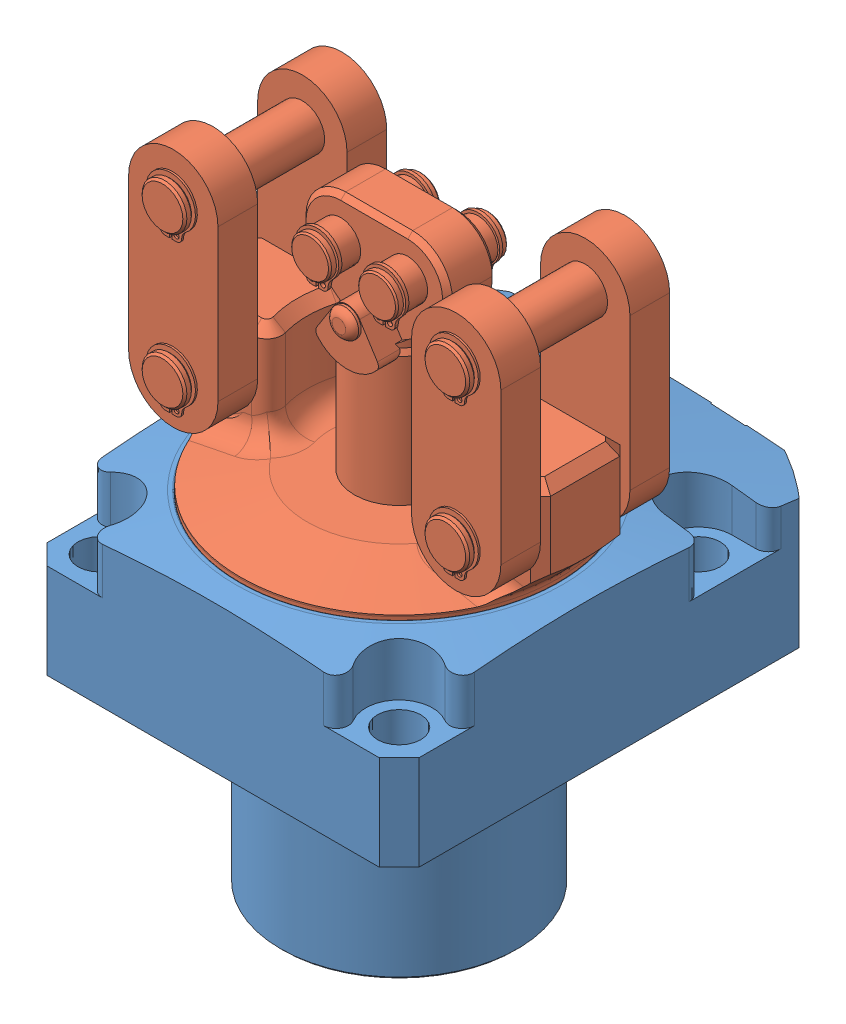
SolidWorks assembly ilcmv41622220.SLDASM, configuration Default (file format 13000). Lengths in mm.
Overall size (75.02 122.31 87.5).
2 component instances, 2 part files, 3 mates.
Components (placement in the parent):
- ilcmv41622220_BODY-1: ilcmv41622220_BODY.SLDPRT [Default] at (-64.799 22.3607 67.1103) size (75 68.63 87.5)
- ilcmv41622220_LUG-1: ilcmv41622220_LUG.SLDPRT [Default] at (-64.799 42.3505 67.1103) x (0 0 1) z (-1 0 0) size (63.98 64.02 75.02)
Mates (geometry in assembly coordinates):
- Concentric1: concentric: cylinder of ilmv41622220_BODY-1 through (-64.799 13.3918 67.1103) axis (0 -1 0) radius 32.015; cylinder of ilmv41622220_LUG-1 through (-64.799 58.9818 67.1103) axis (0 1 0) radius 31.9659
- Coincident1: coincident: plane of ilmv41622220_BODY-1 through (-32.784 42.3505 67.1103) normal (0 1 0); plane of ilmv41622220_LUG-1 through (-64.799 42.3505 58.106) normal (0 -1 0)
- Parallel1: parallel aligned: plane of ilmv41622220_BODY-1 through (-102.299 52.6883 104.6103) normal (-1 0 0); plane of ilmv41622220_LUG-1 through (-102.2894 75.8531 76.1146) normal (-1 0 0)
